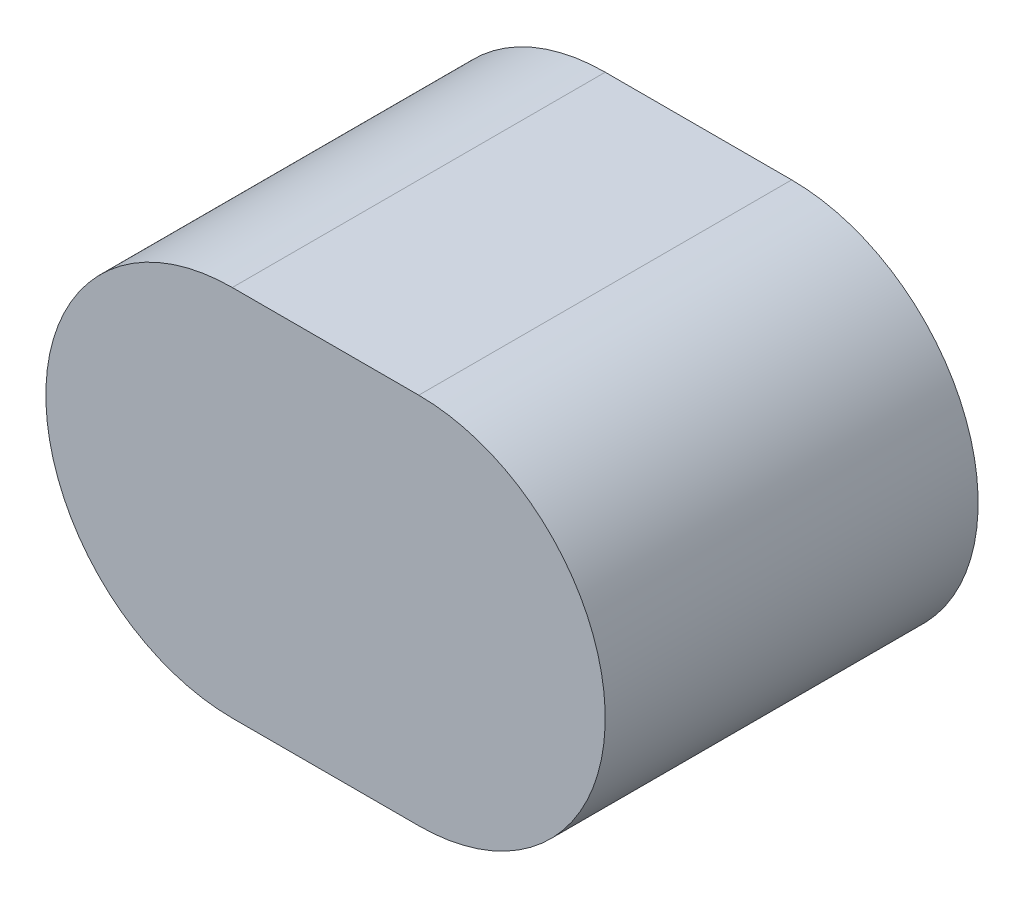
from build123d import *

# Parameters (mm, degrees)
BASE_EXTRUSION_DEPTH = 4


with BuildPart() as part:
    # Esquisse1 → Base-Extrusion (new body)
    with BuildSketch(Plane.XY):
        with BuildLine():
            Line((0, 2), (-2, 2))
            ThreePointArc((-2, 2), (-4, 0), (-2, -2))
            Line((-2, -2), (0, -2))
            ThreePointArc((0, -2), (2, 0), (0, 2))
        make_face()
    extrude(amount=BASE_EXTRUSION_DEPTH)


solid = part.part
